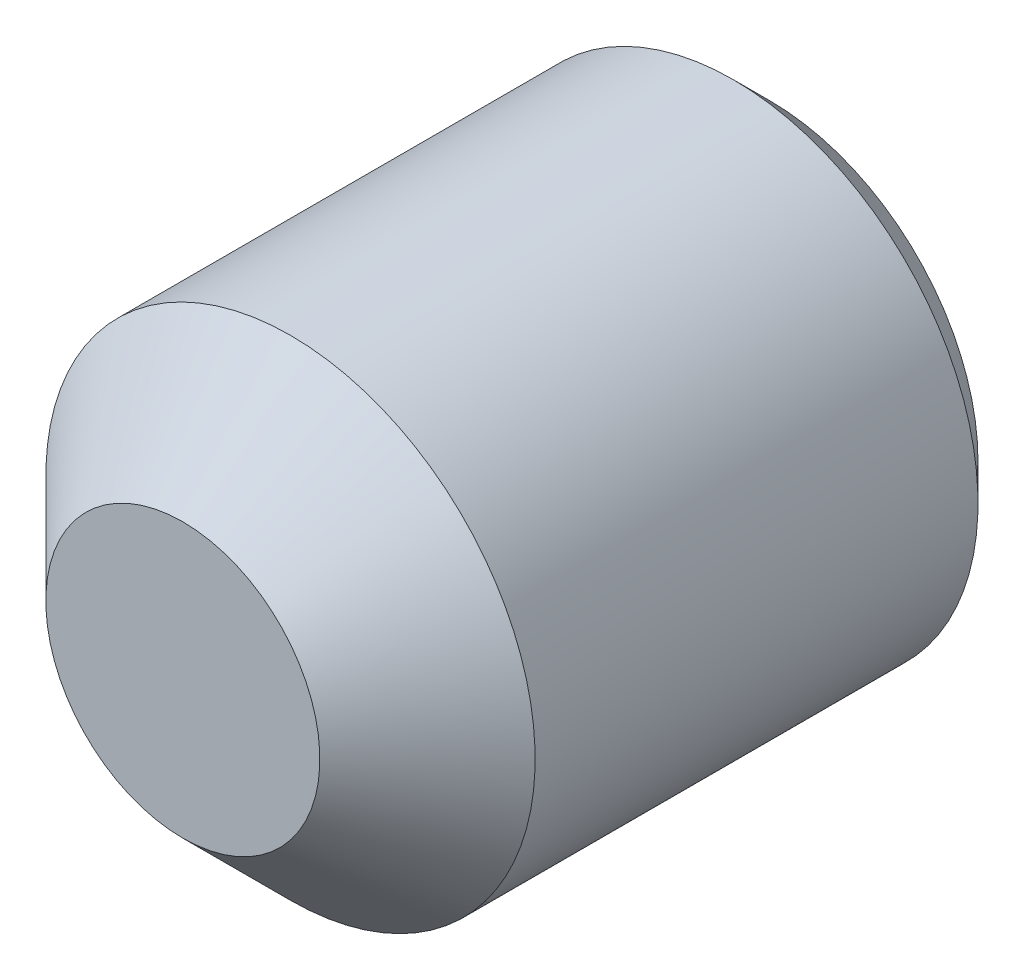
ISO-10303-21;
HEADER;
FILE_DESCRIPTION(('STEP AP214'),'2;1');
FILE_NAME('part.step','',(''),(''),'','','');
FILE_SCHEMA(('AUTOMOTIVE_DESIGN { 1 0 10303 214 1 1 1 1 }'));
ENDSEC;
DATA;
#1=APPLICATION_CONTEXT('core data for automotive mechanical design processes');
#2=APPLICATION_PROTOCOL_DEFINITION('international standard','automotive_design',2000,#1);
#3=PRODUCT_CONTEXT('',#1,'mechanical');
#4=PRODUCT('Part','Part','',(#3));
#5=PRODUCT_RELATED_PRODUCT_CATEGORY('part','',(#4));
#6=PRODUCT_DEFINITION_FORMATION('','',#4);
#7=PRODUCT_DEFINITION_CONTEXT('part definition',#1,'design');
#8=PRODUCT_DEFINITION('design','',#6,#7);
#9=PRODUCT_DEFINITION_SHAPE('','',#8);
#10=(LENGTH_UNIT() NAMED_UNIT(*) SI_UNIT(.MILLI.,.METRE.));
#11=(NAMED_UNIT(*) PLANE_ANGLE_UNIT() SI_UNIT($,.RADIAN.));
#12=(NAMED_UNIT(*) SI_UNIT($,.STERADIAN.) SOLID_ANGLE_UNIT());
#13=UNCERTAINTY_MEASURE_WITH_UNIT(LENGTH_MEASURE(1.E-05),#10,'distance_accuracy_value','');
#14=(GEOMETRIC_REPRESENTATION_CONTEXT(3) GLOBAL_UNCERTAINTY_ASSIGNED_CONTEXT((#13)) GLOBAL_UNIT_ASSIGNED_CONTEXT((#10,
#11,#12)) REPRESENTATION_CONTEXT('',''));
#15=CARTESIAN_POINT('',(0.,0.,0.));
#16=DIRECTION('',(0.,0.,1.));
#17=DIRECTION('',(1.,0.,0.));
#18=AXIS2_PLACEMENT_3D('',#15,#16,#17);
#19=CARTESIAN_POINT('',(0.,2.79999999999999,12.));
#20=DIRECTION('',(0.,0.,-1.));
#21=DIRECTION('',(0.,1.,0.));
#22=AXIS2_PLACEMENT_3D('',#19,#20,#21);
#23=PLANE('',#22);
#24=CARTESIAN_POINT('',(0.,0.,12.));
#25=DIRECTION('',(0.,0.,1.));
#26=DIRECTION('',(0.,-1.,0.));
#27=AXIS2_PLACEMENT_3D('',#24,#25,#26);
#28=CIRCLE('',#27,2.79999999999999);
#29=CARTESIAN_POINT('',(0.,-2.79999999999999,12.));
#30=VERTEX_POINT('',#29);
#31=EDGE_CURVE('E149',#30,#30,#28,.T.);
#32=ORIENTED_EDGE('',*,*,#31,.T.);
#33=EDGE_LOOP('',(#32));
#34=FACE_BOUND('',#33,.T.);
#35=ADVANCED_FACE('F36',(#34),#23,.F.);
#36=CARTESIAN_POINT('',(0.,2.5,0.));
#37=DIRECTION('',(0.,0.,1.));
#38=DIRECTION('',(0.,-1.,0.));
#39=AXIS2_PLACEMENT_3D('',#36,#37,#38);
#40=PLANE('',#39);
#41=CARTESIAN_POINT('',(0.,0.,0.));
#42=DIRECTION('',(0.,0.,1.));
#43=DIRECTION('',(0.,-1.,0.));
#44=AXIS2_PLACEMENT_3D('',#41,#42,#43);
#45=CIRCLE('',#44,4.24);
#46=CARTESIAN_POINT('',(0.,-4.24,0.));
#47=VERTEX_POINT('',#46);
#48=EDGE_CURVE('E178',#47,#47,#45,.T.);
#49=ORIENTED_EDGE('',*,*,#48,.F.);
#50=EDGE_LOOP('',(#49));
#51=FACE_BOUND('',#50,.T.);
#52=DIRECTION('',(0.5,-0.866025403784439,0.));
#53=VECTOR('',#52,1.);
#54=CARTESIAN_POINT('',(-3.24759526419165,0.625000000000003,0.));
#55=LINE('',#54,#53);
#56=CARTESIAN_POINT('',(-2.88675134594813,0.,0.));
#57=VERTEX_POINT('',#56);
#58=CARTESIAN_POINT('',(-1.44337567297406,-2.5,0.));
#59=VERTEX_POINT('',#58);
#60=EDGE_CURVE('E57',#57,#59,#55,.T.);
#61=ORIENTED_EDGE('',*,*,#60,.T.);
#62=DIRECTION('',(1.,0.,0.));
#63=VECTOR('',#62,1.);
#64=CARTESIAN_POINT('',(0.,-2.5,0.));
#65=LINE('',#64,#63);
#66=CARTESIAN_POINT('',(1.44337567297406,-2.5,0.));
#67=VERTEX_POINT('',#66);
#68=EDGE_CURVE('E11',#59,#67,#65,.T.);
#69=ORIENTED_EDGE('',*,*,#68,.T.);
#70=DIRECTION('',(0.5,0.866025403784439,0.));
#71=VECTOR('',#70,1.);
#72=CARTESIAN_POINT('',(3.24759526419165,0.625000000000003,0.));
#73=LINE('',#72,#71);
#74=CARTESIAN_POINT('',(2.88675134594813,0.,0.));
#75=VERTEX_POINT('',#74);
#76=EDGE_CURVE('E43',#67,#75,#73,.T.);
#77=ORIENTED_EDGE('',*,*,#76,.T.);
#78=DIRECTION('',(-0.5,0.866025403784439,0.));
#79=VECTOR('',#78,1.);
#80=CARTESIAN_POINT('',(1.08253175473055,3.125,0.));
#81=LINE('',#80,#79);
#82=CARTESIAN_POINT('',(1.44337567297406,2.5,0.));
#83=VERTEX_POINT('',#82);
#84=EDGE_CURVE('E189',#75,#83,#81,.T.);
#85=ORIENTED_EDGE('',*,*,#84,.T.);
#86=DIRECTION('',(-1.,0.,0.));
#87=VECTOR('',#86,1.);
#88=CARTESIAN_POINT('',(0.,2.5,0.));
#89=LINE('',#88,#87);
#90=CARTESIAN_POINT('',(-1.44337567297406,2.5,0.));
#91=VERTEX_POINT('',#90);
#92=EDGE_CURVE('E187',#83,#91,#89,.T.);
#93=ORIENTED_EDGE('',*,*,#92,.T.);
#94=DIRECTION('',(-0.5,-0.866025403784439,0.));
#95=VECTOR('',#94,1.);
#96=CARTESIAN_POINT('',(-1.08253175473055,3.125,0.));
#97=LINE('',#96,#95);
#98=EDGE_CURVE('E185',#91,#57,#97,.T.);
#99=ORIENTED_EDGE('',*,*,#98,.T.);
#100=EDGE_LOOP('',(#61,#69,#77,#85,#93,#99));
#101=FACE_BOUND('',#100,.T.);
#102=ADVANCED_FACE('F192',(#51,#101),#40,.F.);
#103=CARTESIAN_POINT('',(0.,0.,5.50215154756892));
#104=DIRECTION('',(0.,0.,1.));
#105=DIRECTION('',(0.,-1.,0.));
#106=AXIS2_PLACEMENT_3D('',#103,#104,#105);
#107=CYLINDRICAL_SURFACE('',#106,4.24);
#108=CARTESIAN_POINT('',(0.,0.,10.5458578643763));
#109=DIRECTION('',(0.,0.,1.));
#110=DIRECTION('',(0.,-1.,0.));
#111=AXIS2_PLACEMENT_3D('',#108,#109,#110);
#112=CIRCLE('',#111,4.24);
#113=CARTESIAN_POINT('',(0.,-4.24,10.5458578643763));
#114=VERTEX_POINT('',#113);
#115=EDGE_CURVE('E175',#114,#114,#112,.T.);
#116=ORIENTED_EDGE('',*,*,#115,.F.);
#117=EDGE_LOOP('',(#116));
#118=FACE_BOUND('',#117,.T.);
#119=ORIENTED_EDGE('',*,*,#48,.T.);
#120=EDGE_LOOP('',(#119));
#121=FACE_BOUND('',#120,.T.);
#122=ADVANCED_FACE('F248',(#118,#121),#107,.T.);
#123=CARTESIAN_POINT('',(0.,0.,10.5458578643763));
#124=DIRECTION('',(0.,0.,-1.));
#125=DIRECTION('',(0.,1.,0.));
#126=AXIS2_PLACEMENT_3D('',#123,#124,#125);
#127=CONICAL_SURFACE('',#126,4.24,0.785398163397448);
#128=CARTESIAN_POINT('',(0.,0.,10.5358578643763));
#129=DIRECTION('',(0.,0.,1.));
#130=DIRECTION('',(0.,-1.,0.));
#131=AXIS2_PLACEMENT_3D('',#128,#129,#130);
#132=CIRCLE('',#131,4.25);
#133=CARTESIAN_POINT('',(0.,-4.25,10.5358578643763));
#134=VERTEX_POINT('',#133);
#135=EDGE_CURVE('E172',#134,#134,#132,.T.);
#136=ORIENTED_EDGE('',*,*,#135,.F.);
#137=EDGE_LOOP('',(#136));
#138=FACE_BOUND('',#137,.T.);
#139=ORIENTED_EDGE('',*,*,#115,.T.);
#140=EDGE_LOOP('',(#139));
#141=FACE_BOUND('',#140,.T.);
#142=ADVANCED_FACE('F273',(#138,#141),#127,.F.);
#143=CARTESIAN_POINT('',(0.,0.,5.50215154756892));
#144=DIRECTION('',(0.,0.,1.));
#145=DIRECTION('',(0.,-1.,0.));
#146=AXIS2_PLACEMENT_3D('',#143,#144,#145);
#147=CYLINDRICAL_SURFACE('',#146,4.25);
#148=CARTESIAN_POINT('',(0.,0.,0.));
#149=DIRECTION('',(0.,0.,1.));
#150=DIRECTION('',(0.,-1.,0.));
#151=AXIS2_PLACEMENT_3D('',#148,#149,#150);
#152=CIRCLE('',#151,4.25);
#153=CARTESIAN_POINT('',(0.,-4.25,0.));
#154=VERTEX_POINT('',#153);
#155=EDGE_CURVE('E169',#154,#154,#152,.T.);
#156=ORIENTED_EDGE('',*,*,#155,.F.);
#157=EDGE_LOOP('',(#156));
#158=FACE_BOUND('',#157,.T.);
#159=ORIENTED_EDGE('',*,*,#135,.T.);
#160=EDGE_LOOP('',(#159));
#161=FACE_BOUND('',#160,.T.);
#162=ADVANCED_FACE('F267',(#158,#161),#147,.F.);
#163=CARTESIAN_POINT('',(0.,0.,0.));
#164=DIRECTION('',(0.,0.,1.));
#165=DIRECTION('',(0.,-1.,0.));
#166=AXIS2_PLACEMENT_3D('',#163,#164,#165);
#167=CONICAL_SURFACE('',#166,4.25,0.785398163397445);
#168=CARTESIAN_POINT('',(0.,0.,0.750000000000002));
#169=DIRECTION('',(0.,0.,1.));
#170=DIRECTION('',(0.,-1.,0.));
#171=AXIS2_PLACEMENT_3D('',#168,#169,#170);
#172=CIRCLE('',#171,5.);
#173=CARTESIAN_POINT('',(0.,-5.,0.750000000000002));
#174=VERTEX_POINT('',#173);
#175=EDGE_CURVE('E166',#174,#174,#172,.T.);
#176=ORIENTED_EDGE('',*,*,#175,.F.);
#177=EDGE_LOOP('',(#176));
#178=FACE_BOUND('',#177,.T.);
#179=ORIENTED_EDGE('',*,*,#155,.T.);
#180=EDGE_LOOP('',(#179));
#181=FACE_BOUND('',#180,.T.);
#182=ADVANCED_FACE('F261',(#178,#181),#167,.T.);
#183=CARTESIAN_POINT('',(0.,0.,5.50215154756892));
#184=DIRECTION('',(0.,0.,1.));
#185=DIRECTION('',(0.,-1.,0.));
#186=AXIS2_PLACEMENT_3D('',#183,#184,#185);
#187=CYLINDRICAL_SURFACE('',#186,5.);
#188=CARTESIAN_POINT('',(0.,0.,9.8));
#189=DIRECTION('',(0.,0.,1.));
#190=DIRECTION('',(0.,-1.,0.));
#191=AXIS2_PLACEMENT_3D('',#188,#189,#190);
#192=CIRCLE('',#191,5.);
#193=CARTESIAN_POINT('',(0.,-5.,9.8));
#194=VERTEX_POINT('',#193);
#195=EDGE_CURVE('E163',#194,#194,#192,.T.);
#196=ORIENTED_EDGE('',*,*,#195,.F.);
#197=EDGE_LOOP('',(#196));
#198=FACE_BOUND('',#197,.T.);
#199=ORIENTED_EDGE('',*,*,#175,.T.);
#200=EDGE_LOOP('',(#199));
#201=FACE_BOUND('',#200,.T.);
#202=ADVANCED_FACE('F255',(#198,#201),#187,.T.);
#203=CARTESIAN_POINT('',(0.,0.,9.8));
#204=DIRECTION('',(0.,0.,-1.));
#205=DIRECTION('',(0.,1.,0.));
#206=AXIS2_PLACEMENT_3D('',#203,#204,#205);
#207=CONICAL_SURFACE('',#206,5.,0.785398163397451);
#208=ORIENTED_EDGE('',*,*,#31,.F.);
#209=EDGE_LOOP('',(#208));
#210=FACE_BOUND('',#209,.T.);
#211=ORIENTED_EDGE('',*,*,#195,.T.);
#212=EDGE_LOOP('',(#211));
#213=FACE_BOUND('',#212,.T.);
#214=ADVANCED_FACE('F242',(#210,#213),#207,.T.);
#215=CARTESIAN_POINT('',(0.,0.,4.));
#216=DIRECTION('',(0.,0.,-1.));
#217=DIRECTION('',(0.,1.,0.));
#218=AXIS2_PLACEMENT_3D('',#215,#216,#217);
#219=PLANE('',#218);
#220=CARTESIAN_POINT('',(0.,0.,4.));
#221=DIRECTION('',(0.,0.,1.));
#222=DIRECTION('',(0.,-1.,0.));
#223=AXIS2_PLACEMENT_3D('',#220,#221,#222);
#224=CIRCLE('',#223,2.5);
#225=CARTESIAN_POINT('',(0.,2.5,4.));
#226=VERTEX_POINT('',#225);
#227=CARTESIAN_POINT('',(-2.1650635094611,1.25,4.));
#228=VERTEX_POINT('',#227);
#229=EDGE_CURVE('E214',#226,#228,#224,.T.);
#230=ORIENTED_EDGE('',*,*,#229,.T.);
#231=DIRECTION('',(0.5,0.866025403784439,0.));
#232=VECTOR('',#231,1.);
#233=CARTESIAN_POINT('',(-2.88675134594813,0.,4.));
#234=LINE('',#233,#232);
#235=CARTESIAN_POINT('',(-1.44337567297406,2.5,4.));
#236=VERTEX_POINT('',#235);
#237=EDGE_CURVE('E132',#228,#236,#234,.T.);
#238=ORIENTED_EDGE('',*,*,#237,.T.);
#239=DIRECTION('',(1.,0.,0.));
#240=VECTOR('',#239,1.);
#241=CARTESIAN_POINT('',(-1.44337567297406,2.5,4.));
#242=LINE('',#241,#240);
#243=EDGE_CURVE('E139',#236,#226,#242,.T.);
#244=ORIENTED_EDGE('',*,*,#243,.T.);
#245=EDGE_LOOP('',(#230,#238,#244));
#246=FACE_BOUND('',#245,.T.);
#247=ADVANCED_FACE('F228',(#246),#219,.T.);
#248=CARTESIAN_POINT('',(-2.1650635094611,-1.25,4.));
#249=VERTEX_POINT('',#248);
#250=EDGE_CURVE('E216',#228,#249,#224,.T.);
#251=ORIENTED_EDGE('',*,*,#250,.T.);
#252=DIRECTION('',(-0.5,0.866025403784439,0.));
#253=VECTOR('',#252,1.);
#254=CARTESIAN_POINT('',(-1.44337567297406,-2.5,4.));
#255=LINE('',#254,#253);
#256=CARTESIAN_POINT('',(-2.88675134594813,0.,4.));
#257=VERTEX_POINT('',#256);
#258=EDGE_CURVE('E131',#249,#257,#255,.T.);
#259=ORIENTED_EDGE('',*,*,#258,.T.);
#260=EDGE_CURVE('E134',#257,#228,#234,.T.);
#261=ORIENTED_EDGE('',*,*,#260,.T.);
#262=EDGE_LOOP('',(#251,#259,#261));
#263=FACE_BOUND('',#262,.T.);
#264=ADVANCED_FACE('F221',(#263),#219,.T.);
#265=CARTESIAN_POINT('',(0.,-2.5,4.));
#266=VERTEX_POINT('',#265);
#267=EDGE_CURVE('E114',#249,#266,#224,.T.);
#268=ORIENTED_EDGE('',*,*,#267,.T.);
#269=DIRECTION('',(-1.,0.,0.));
#270=VECTOR('',#269,1.);
#271=CARTESIAN_POINT('',(1.44337567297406,-2.5,4.));
#272=LINE('',#271,#270);
#273=CARTESIAN_POINT('',(-1.44337567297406,-2.5,4.));
#274=VERTEX_POINT('',#273);
#275=EDGE_CURVE('E108',#266,#274,#272,.T.);
#276=ORIENTED_EDGE('',*,*,#275,.T.);
#277=EDGE_CURVE('E112',#274,#249,#255,.T.);
#278=ORIENTED_EDGE('',*,*,#277,.T.);
#279=EDGE_LOOP('',(#268,#276,#278));
#280=FACE_BOUND('',#279,.T.);
#281=ADVANCED_FACE('F110',(#280),#219,.T.);
#282=CARTESIAN_POINT('',(2.1650635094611,-1.25,4.));
#283=VERTEX_POINT('',#282);
#284=EDGE_CURVE('E181',#266,#283,#224,.T.);
#285=ORIENTED_EDGE('',*,*,#284,.T.);
#286=DIRECTION('',(-0.5,-0.866025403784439,0.));
#287=VECTOR('',#286,1.);
#288=CARTESIAN_POINT('',(2.88675134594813,0.,4.));
#289=LINE('',#288,#287);
#290=CARTESIAN_POINT('',(1.44337567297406,-2.5,4.));
#291=VERTEX_POINT('',#290);
#292=EDGE_CURVE('E144',#283,#291,#289,.T.);
#293=ORIENTED_EDGE('',*,*,#292,.T.);
#294=EDGE_CURVE('E118',#291,#266,#272,.T.);
#295=ORIENTED_EDGE('',*,*,#294,.T.);
#296=EDGE_LOOP('',(#285,#293,#295));
#297=FACE_BOUND('',#296,.T.);
#298=ADVANCED_FACE('F239',(#297),#219,.T.);
#299=CARTESIAN_POINT('',(2.1650635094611,1.25,4.));
#300=VERTEX_POINT('',#299);
#301=EDGE_CURVE('E183',#283,#300,#224,.T.);
#302=ORIENTED_EDGE('',*,*,#301,.T.);
#303=DIRECTION('',(0.5,-0.866025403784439,0.));
#304=VECTOR('',#303,1.);
#305=CARTESIAN_POINT('',(1.44337567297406,2.5,4.));
#306=LINE('',#305,#304);
#307=CARTESIAN_POINT('',(2.88675134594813,0.,4.));
#308=VERTEX_POINT('',#307);
#309=EDGE_CURVE('E142',#300,#308,#306,.T.);
#310=ORIENTED_EDGE('',*,*,#309,.T.);
#311=EDGE_CURVE('E126',#308,#283,#289,.T.);
#312=ORIENTED_EDGE('',*,*,#311,.T.);
#313=EDGE_LOOP('',(#302,#310,#312));
#314=FACE_BOUND('',#313,.T.);
#315=ADVANCED_FACE('F206',(#314),#219,.T.);
#316=EDGE_CURVE('E213',#300,#226,#224,.T.);
#317=ORIENTED_EDGE('',*,*,#316,.T.);
#318=CARTESIAN_POINT('',(1.44337567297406,2.5,4.));
#319=VERTEX_POINT('',#318);
#320=EDGE_CURVE('E138',#226,#319,#242,.T.);
#321=ORIENTED_EDGE('',*,*,#320,.T.);
#322=EDGE_CURVE('E50',#319,#300,#306,.T.);
#323=ORIENTED_EDGE('',*,*,#322,.T.);
#324=EDGE_LOOP('',(#317,#321,#323));
#325=FACE_BOUND('',#324,.T.);
#326=ADVANCED_FACE('F231',(#325),#219,.T.);
#327=CARTESIAN_POINT('',(1.44337567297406,-2.5,4.));
#328=DIRECTION('',(0.,-1.,0.));
#329=DIRECTION('',(0.,0.,-1.));
#330=AXIS2_PLACEMENT_3D('',#327,#328,#329);
#331=PLANE('',#330);
#332=ORIENTED_EDGE('',*,*,#294,.F.);
#333=DIRECTION('',(0.,0.,-1.));
#334=VECTOR('',#333,1.);
#335=CARTESIAN_POINT('',(1.44337567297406,-2.5,4.));
#336=LINE('',#335,#334);
#337=EDGE_CURVE('E147',#291,#67,#336,.T.);
#338=ORIENTED_EDGE('',*,*,#337,.T.);
#339=ORIENTED_EDGE('',*,*,#68,.F.);
#340=DIRECTION('',(0.,0.,-1.));
#341=VECTOR('',#340,1.);
#342=CARTESIAN_POINT('',(-1.44337567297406,-2.5,4.));
#343=LINE('',#342,#341);
#344=EDGE_CURVE('E121',#274,#59,#343,.T.);
#345=ORIENTED_EDGE('',*,*,#344,.F.);
#346=ORIENTED_EDGE('',*,*,#275,.F.);
#347=EDGE_LOOP('',(#332,#338,#339,#345,#346));
#348=FACE_BOUND('',#347,.T.);
#349=ADVANCED_FACE('F122',(#348),#331,.F.);
#350=CARTESIAN_POINT('',(2.88675134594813,0.,4.));
#351=DIRECTION('',(0.866025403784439,-0.5,0.));
#352=DIRECTION('',(0.5,0.866025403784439,0.));
#353=AXIS2_PLACEMENT_3D('',#350,#351,#352);
#354=PLANE('',#353);
#355=ORIENTED_EDGE('',*,*,#311,.F.);
#356=DIRECTION('',(0.,0.,-1.));
#357=VECTOR('',#356,1.);
#358=CARTESIAN_POINT('',(2.88675134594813,0.,4.));
#359=LINE('',#358,#357);
#360=EDGE_CURVE('E150',#308,#75,#359,.T.);
#361=ORIENTED_EDGE('',*,*,#360,.T.);
#362=ORIENTED_EDGE('',*,*,#76,.F.);
#363=ORIENTED_EDGE('',*,*,#337,.F.);
#364=ORIENTED_EDGE('',*,*,#292,.F.);
#365=EDGE_LOOP('',(#355,#361,#362,#363,#364));
#366=FACE_BOUND('',#365,.T.);
#367=ADVANCED_FACE('F201',(#366),#354,.F.);
#368=CARTESIAN_POINT('',(1.44337567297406,2.5,4.));
#369=DIRECTION('',(0.866025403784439,0.5,0.));
#370=DIRECTION('',(-0.5,0.866025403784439,0.));
#371=AXIS2_PLACEMENT_3D('',#368,#369,#370);
#372=PLANE('',#371);
#373=ORIENTED_EDGE('',*,*,#322,.F.);
#374=DIRECTION('',(0.,0.,-1.));
#375=VECTOR('',#374,1.);
#376=CARTESIAN_POINT('',(1.44337567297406,2.5,4.));
#377=LINE('',#376,#375);
#378=EDGE_CURVE('E153',#319,#83,#377,.T.);
#379=ORIENTED_EDGE('',*,*,#378,.T.);
#380=ORIENTED_EDGE('',*,*,#84,.F.);
#381=ORIENTED_EDGE('',*,*,#360,.F.);
#382=ORIENTED_EDGE('',*,*,#309,.F.);
#383=EDGE_LOOP('',(#373,#379,#380,#381,#382));
#384=FACE_BOUND('',#383,.T.);
#385=ADVANCED_FACE('F198',(#384),#372,.F.);
#386=CARTESIAN_POINT('',(-1.44337567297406,2.5,4.));
#387=DIRECTION('',(0.,1.,0.));
#388=DIRECTION('',(0.,0.,1.));
#389=AXIS2_PLACEMENT_3D('',#386,#387,#388);
#390=PLANE('',#389);
#391=ORIENTED_EDGE('',*,*,#243,.F.);
#392=DIRECTION('',(0.,0.,-1.));
#393=VECTOR('',#392,1.);
#394=CARTESIAN_POINT('',(-1.44337567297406,2.5,4.));
#395=LINE('',#394,#393);
#396=EDGE_CURVE('E156',#236,#91,#395,.T.);
#397=ORIENTED_EDGE('',*,*,#396,.T.);
#398=ORIENTED_EDGE('',*,*,#92,.F.);
#399=ORIENTED_EDGE('',*,*,#378,.F.);
#400=ORIENTED_EDGE('',*,*,#320,.F.);
#401=EDGE_LOOP('',(#391,#397,#398,#399,#400));
#402=FACE_BOUND('',#401,.T.);
#403=ADVANCED_FACE('F230',(#402),#390,.F.);
#404=CARTESIAN_POINT('',(-2.88675134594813,0.,4.));
#405=DIRECTION('',(-0.866025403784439,0.5,0.));
#406=DIRECTION('',(-0.5,-0.866025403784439,0.));
#407=AXIS2_PLACEMENT_3D('',#404,#405,#406);
#408=PLANE('',#407);
#409=ORIENTED_EDGE('',*,*,#260,.F.);
#410=DIRECTION('',(0.,0.,-1.));
#411=VECTOR('',#410,1.);
#412=CARTESIAN_POINT('',(-2.88675134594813,0.,4.));
#413=LINE('',#412,#411);
#414=EDGE_CURVE('E125',#257,#57,#413,.T.);
#415=ORIENTED_EDGE('',*,*,#414,.T.);
#416=ORIENTED_EDGE('',*,*,#98,.F.);
#417=ORIENTED_EDGE('',*,*,#396,.F.);
#418=ORIENTED_EDGE('',*,*,#237,.F.);
#419=EDGE_LOOP('',(#409,#415,#416,#417,#418));
#420=FACE_BOUND('',#419,.T.);
#421=ADVANCED_FACE('F224',(#420),#408,.F.);
#422=CARTESIAN_POINT('',(-1.44337567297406,-2.5,4.));
#423=DIRECTION('',(-0.866025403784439,-0.5,0.));
#424=DIRECTION('',(0.5,-0.866025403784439,0.));
#425=AXIS2_PLACEMENT_3D('',#422,#423,#424);
#426=PLANE('',#425);
#427=ORIENTED_EDGE('',*,*,#277,.F.);
#428=ORIENTED_EDGE('',*,*,#344,.T.);
#429=ORIENTED_EDGE('',*,*,#60,.F.);
#430=ORIENTED_EDGE('',*,*,#414,.F.);
#431=ORIENTED_EDGE('',*,*,#258,.F.);
#432=EDGE_LOOP('',(#427,#428,#429,#430,#431));
#433=FACE_BOUND('',#432,.T.);
#434=ADVANCED_FACE('F129',(#433),#426,.F.);
#435=CARTESIAN_POINT('',(0.,0.,5.50215154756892));
#436=DIRECTION('',(0.,0.,-1.));
#437=DIRECTION('',(0.,1.,0.));
#438=AXIS2_PLACEMENT_3D('',#435,#436,#437);
#439=CONICAL_SURFACE('',#438,0.,1.02974425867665);
#440=ORIENTED_EDGE('',*,*,#284,.F.);
#441=ORIENTED_EDGE('',*,*,#267,.F.);
#442=ORIENTED_EDGE('',*,*,#250,.F.);
#443=ORIENTED_EDGE('',*,*,#229,.F.);
#444=ORIENTED_EDGE('',*,*,#316,.F.);
#445=ORIENTED_EDGE('',*,*,#301,.F.);
#446=EDGE_LOOP('',(#440,#441,#442,#443,#444,#445));
#447=FACE_BOUND('',#446,.T.);
#448=CARTESIAN_POINT('',(0.,0.,5.50215154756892));
#449=VERTEX_POINT('',#448);
#450=VERTEX_LOOP('',#449);
#451=FACE_BOUND('',#450,.T.);
#452=ADVANCED_FACE('F210',(#447,#451),#439,.F.);
#453=CLOSED_SHELL('',(#35,#102,#122,#142,#162,#182,#202,#214,#247,#264,#281,#298,#315,#326,#349,
#367,#385,#403,#421,#434,#452));
#454=MANIFOLD_SOLID_BREP('B2',#453);
#455=ADVANCED_BREP_SHAPE_REPRESENTATION('',(#18,#454),#14);
#456=SHAPE_DEFINITION_REPRESENTATION(#9,#455);
ENDSEC;
END-ISO-10303-21;
